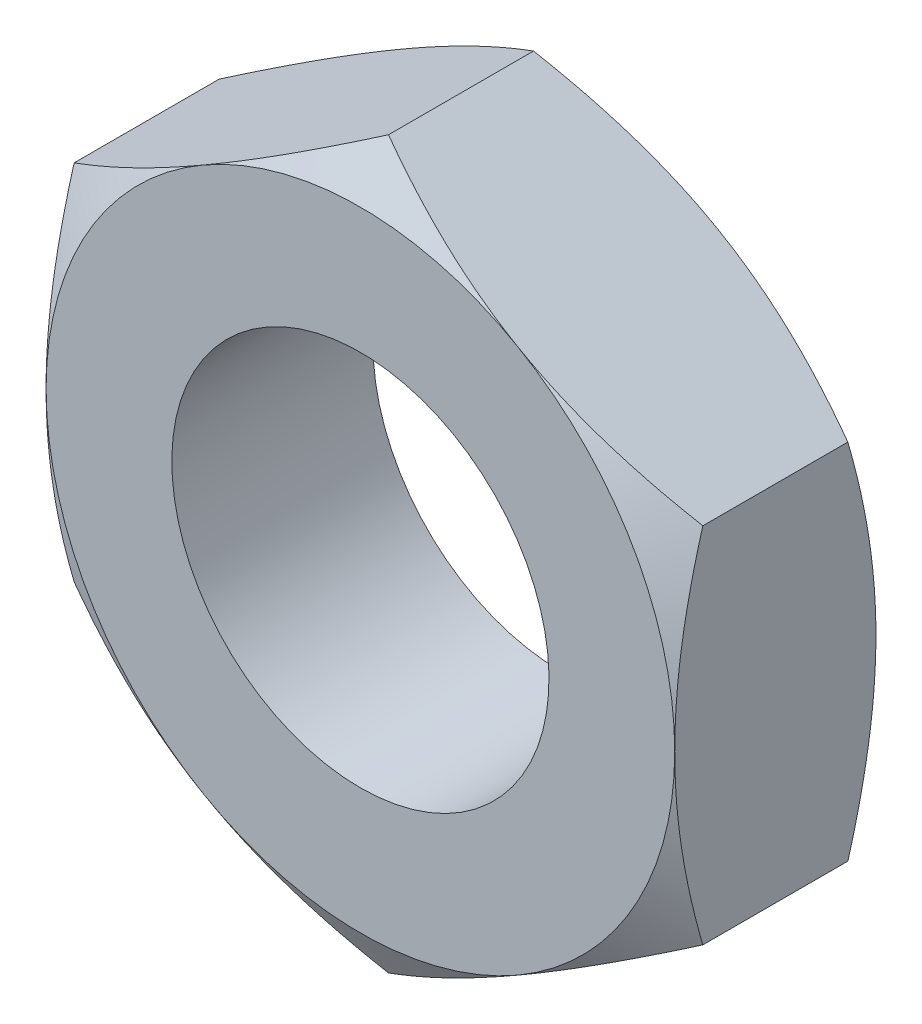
ISO-10303-21;
HEADER;
FILE_DESCRIPTION(('STEP AP214'),'2;1');
FILE_NAME('part.step','',(''),(''),'','','');
FILE_SCHEMA(('AUTOMOTIVE_DESIGN { 1 0 10303 214 1 1 1 1 }'));
ENDSEC;
DATA;
#1=APPLICATION_CONTEXT('core data for automotive mechanical design processes');
#2=APPLICATION_PROTOCOL_DEFINITION('international standard','automotive_design',2000,#1);
#3=PRODUCT_CONTEXT('',#1,'mechanical');
#4=PRODUCT('Part','Part','',(#3));
#5=PRODUCT_RELATED_PRODUCT_CATEGORY('part','',(#4));
#6=PRODUCT_DEFINITION_FORMATION('','',#4);
#7=PRODUCT_DEFINITION_CONTEXT('part definition',#1,'design');
#8=PRODUCT_DEFINITION('design','',#6,#7);
#9=PRODUCT_DEFINITION_SHAPE('','',#8);
#10=(LENGTH_UNIT() NAMED_UNIT(*) SI_UNIT(.MILLI.,.METRE.));
#11=(NAMED_UNIT(*) PLANE_ANGLE_UNIT() SI_UNIT($,.RADIAN.));
#12=(NAMED_UNIT(*) SI_UNIT($,.STERADIAN.) SOLID_ANGLE_UNIT());
#13=UNCERTAINTY_MEASURE_WITH_UNIT(LENGTH_MEASURE(1.E-05),#10,'distance_accuracy_value','');
#14=(GEOMETRIC_REPRESENTATION_CONTEXT(3) GLOBAL_UNCERTAINTY_ASSIGNED_CONTEXT((#13)) GLOBAL_UNIT_ASSIGNED_CONTEXT((#10,
#11,#12)) REPRESENTATION_CONTEXT('',''));
#15=CARTESIAN_POINT('',(0.,0.,0.));
#16=DIRECTION('',(0.,0.,1.));
#17=DIRECTION('',(1.,0.,0.));
#18=AXIS2_PLACEMENT_3D('',#15,#16,#17);
#19=CARTESIAN_POINT('',(0.,0.,3.2));
#20=DIRECTION('',(0.,0.,-1.));
#21=DIRECTION('',(1.,0.,0.));
#22=AXIS2_PLACEMENT_3D('',#19,#20,#21);
#23=CONICAL_SURFACE('',#22,5.,1.0471975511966);
#24=CARTESIAN_POINT('',(-0.000200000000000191,-5.77361816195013,2.75335134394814));
#25=CARTESIAN_POINT('',(0.219534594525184,-5.64675433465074,2.82661343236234));
#26=CARTESIAN_POINT('',(0.441148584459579,-5.51880543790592,2.89324867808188));
#27=CARTESIAN_POINT('',(0.888213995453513,-5.2606921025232,3.00956100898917));
#28=CARTESIAN_POINT('',(1.11367335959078,-5.13052307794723,3.05919695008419));
#29=CARTESIAN_POINT('',(1.56183230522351,-4.87177839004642,3.13644897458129));
#30=CARTESIAN_POINT('',(1.7844620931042,-4.74324302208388,3.1645796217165));
#31=CARTESIAN_POINT('',(2.11918990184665,-4.54998783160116,3.18980507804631));
#32=CARTESIAN_POINT('',(2.23084219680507,-4.48552534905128,3.19538654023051));
#33=CARTESIAN_POINT('',(2.4542499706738,-4.35654081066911,3.20079778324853));
#34=CARTESIAN_POINT('',(2.56600544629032,-4.29201875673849,3.2006277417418));
#35=CARTESIAN_POINT('',(2.87218423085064,-4.11524635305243,3.19224636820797));
#36=CARTESIAN_POINT('',(3.06650608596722,-4.00305457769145,3.17817022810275));
#37=CARTESIAN_POINT('',(3.45386010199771,-3.77941563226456,3.13353474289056));
#38=CARTESIAN_POINT('',(3.64689090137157,-3.66796924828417,3.10296013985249));
#39=CARTESIAN_POINT('',(4.03502534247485,-3.44387972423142,3.02653150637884));
#40=CARTESIAN_POINT('',(4.23007999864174,-3.33126486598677,2.98035362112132));
#41=CARTESIAN_POINT('',(4.61728034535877,-3.10771464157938,2.87554820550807));
#42=CARTESIAN_POINT('',(4.80943099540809,-2.99677641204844,2.81694529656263));
#43=CARTESIAN_POINT('',(5.0002,-2.88663587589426,2.75335134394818));
#44=B_SPLINE_CURVE_WITH_KNOTS('',3,(#24,#25,#26,#27,#28,#29,#30,#31,#32,#33,#34,#35,#36,#37,#38,
#39,#40,#41,#42,#43),.UNSPECIFIED.,.F.,.F.,(4,2,2,2,2,2,2,2,2,4),(0.,0.792555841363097,
1.58701660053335,2.36181537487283,2.74884076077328,3.13585419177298,3.80962362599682,
4.48401723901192,5.17336882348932,5.86136694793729),.UNSPECIFIED.);
#45=CARTESIAN_POINT('',(2.50000000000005,-4.33012701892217,3.2));
#46=VERTEX_POINT('',#45);
#47=CARTESIAN_POINT('',(5.,-2.88675134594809,2.7534180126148));
#48=VERTEX_POINT('',#47);
#49=EDGE_CURVE('E186',#46,#48,#44,.T.);
#50=ORIENTED_EDGE('',*,*,#49,.T.);
#51=CARTESIAN_POINT('',(5.,7.81723155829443,0.729229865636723));
#52=CARTESIAN_POINT('',(5.,7.59831721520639,0.83567496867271));
#53=CARTESIAN_POINT('',(5.,7.37890707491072,0.941117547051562));
#54=CARTESIAN_POINT('',(5.,6.93883178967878,1.14943507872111));
#55=CARTESIAN_POINT('',(5.,6.71816645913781,1.25230963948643));
#56=CARTESIAN_POINT('',(5.,6.27421035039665,1.45543273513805));
#57=CARTESIAN_POINT('',(5.,6.05091185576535,1.55566446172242));
#58=CARTESIAN_POINT('',(5.,5.60256083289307,1.7521097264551));
#59=CARTESIAN_POINT('',(5.,5.377508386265,1.84832345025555));
#60=CARTESIAN_POINT('',(5.,4.9177769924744,2.03878733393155));
#61=CARTESIAN_POINT('',(5.,4.68302663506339,2.1328660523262));
#62=CARTESIAN_POINT('',(5.,4.21080279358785,2.31405477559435));
#63=CARTESIAN_POINT('',(5.,3.97332901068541,2.40116400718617));
#64=CARTESIAN_POINT('',(5.,3.495705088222,2.56617303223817));
#65=CARTESIAN_POINT('',(5.,3.25556126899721,2.64409093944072));
#66=CARTESIAN_POINT('',(5.,2.77182902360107,2.78825869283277));
#67=CARTESIAN_POINT('',(5.,2.52824168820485,2.85451214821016));
#68=CARTESIAN_POINT('',(5.,2.03885564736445,2.97185534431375));
#69=CARTESIAN_POINT('',(5.,1.79307767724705,3.0230299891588));
#70=CARTESIAN_POINT('',(5.,1.29839972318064,3.10737105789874));
#71=CARTESIAN_POINT('',(5.,1.04950005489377,3.14053928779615));
#72=CARTESIAN_POINT('',(5.,0.55309848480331,3.18579003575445));
#73=CARTESIAN_POINT('',(5.,0.305622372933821,3.1981484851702));
#74=CARTESIAN_POINT('',(5.,-0.189495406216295,3.20146223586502));
#75=CARTESIAN_POINT('',(5.,-0.437137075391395,3.19241728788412));
#76=CARTESIAN_POINT('',(5.,-0.855712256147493,3.15968627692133));
#77=CARTESIAN_POINT('',(5.,-1.02708560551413,3.14128520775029));
#78=CARTESIAN_POINT('',(5.,-1.36861132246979,3.09534502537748));
#79=CARTESIAN_POINT('',(5.,-1.53876352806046,3.06780472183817));
#80=CARTESIAN_POINT('',(5.,-2.04714382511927,2.97291886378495));
#81=CARTESIAN_POINT('',(5.,-2.383113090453,2.89332456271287));
#82=CARTESIAN_POINT('',(5.,-2.88555192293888,2.75488137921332));
#83=CARTESIAN_POINT('',(5.,-3.05461483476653,2.70490439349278));
#84=CARTESIAN_POINT('',(5.,-3.39109942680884,2.59965290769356));
#85=CARTESIAN_POINT('',(5.,-3.55852109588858,2.54437837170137));
#86=CARTESIAN_POINT('',(5.,-3.89177405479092,2.42942761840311));
#87=CARTESIAN_POINT('',(5.,-4.05760582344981,2.36975277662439));
#88=CARTESIAN_POINT('',(5.,-4.38788840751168,2.24671405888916));
#89=CARTESIAN_POINT('',(5.,-4.55233924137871,2.18335023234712));
#90=CARTESIAN_POINT('',(5.,-4.94898502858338,2.02622090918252));
#91=CARTESIAN_POINT('',(5.,-5.18055706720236,1.93088560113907));
#92=CARTESIAN_POINT('',(5.,-5.64164975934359,1.73536213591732));
#93=CARTESIAN_POINT('',(5.,-5.87117026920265,1.63517364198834));
#94=CARTESIAN_POINT('',(5.,-6.32855073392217,1.43094756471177));
#95=CARTESIAN_POINT('',(5.,-6.55641029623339,1.32690910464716));
#96=CARTESIAN_POINT('',(5.,-7.01070900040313,1.11577097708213));
#97=CARTESIAN_POINT('',(5.,-7.23714810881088,1.00867123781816));
#98=CARTESIAN_POINT('',(5.,-7.91522882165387,0.683446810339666));
#99=CARTESIAN_POINT('',(5.,-8.36510205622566,0.461637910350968));
#100=CARTESIAN_POINT('',(5.,-9.26147134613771,0.0114931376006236));
#101=CARTESIAN_POINT('',(5.,-9.70796785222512,-0.216841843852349));
#102=CARTESIAN_POINT('',(5.,-10.5595470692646,-0.657922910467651));
#103=CARTESIAN_POINT('',(5.,-10.9648306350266,-0.870281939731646));
#104=CARTESIAN_POINT('',(5.,-11.7738959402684,-1.29787596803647));
#105=CARTESIAN_POINT('',(5.,-12.1776776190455,-1.51311108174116));
#106=CARTESIAN_POINT('',(5.,-12.9829857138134,-1.94518053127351));
#107=CARTESIAN_POINT('',(5.,-13.3845152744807,-2.16200901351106));
#108=CARTESIAN_POINT('',(5.,-14.1866188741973,-2.59736989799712));
#109=CARTESIAN_POINT('',(5.,-14.5871929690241,-2.81590219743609));
#110=CARTESIAN_POINT('',(5.,-14.9874182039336,-3.03506690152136));
#111=B_SPLINE_CURVE_WITH_KNOTS('',3,(#51,#52,#53,#54,#55,#56,#57,#58,#59,#60,#61,#62,#63,#64,
#65,#66,#67,#68,#69,#70,#71,#72,#73,#74,#75,#76,#77,#78,#79,#80,#81,#82,#83,#84,#85,#86,#87,#88,
#89,#90,#91,#92,#93,#94,#95,#96,#97,#98,#99,#100,#101,#102,#103,#104,#105,#106,#107,#108,#109,
#110),.UNSPECIFIED.,.F.,.F.,(4,2,2,2,2,2,2,2,2,2,2,2,2,2,2,2,2,2,2,2,2,2,2,2,2,2,2,2,2,4),(0.,
0.730273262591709,1.4606574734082,2.19491284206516,2.92913424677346,3.68774942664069,
4.44644866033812,5.20362678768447,5.96057021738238,6.71316630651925,7.46568689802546,
8.20814835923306,8.95061846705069,9.4674441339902,9.98433714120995,11.0186703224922,
11.5475092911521,12.0763518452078,12.605029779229,13.1337006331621,13.8849102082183,
14.6361719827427,15.3876059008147,16.1390574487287,17.6437115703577,19.148161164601,
20.5207929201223,21.8934795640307,23.2624765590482,24.631391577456),.UNSPECIFIED.);
#112=CARTESIAN_POINT('',(5.,0.,3.2));
#113=VERTEX_POINT('',#112);
#114=EDGE_CURVE('E210',#48,#113,#111,.F.);
#115=ORIENTED_EDGE('',*,*,#114,.T.);
#116=CARTESIAN_POINT('',(0.,0.,3.2));
#117=DIRECTION('',(0.,0.,-1.));
#118=DIRECTION('',(1.,0.,0.));
#119=AXIS2_PLACEMENT_3D('',#116,#117,#118);
#120=CIRCLE('',#119,5.);
#121=EDGE_CURVE('E281',#113,#46,#120,.T.);
#122=ORIENTED_EDGE('',*,*,#121,.T.);
#123=EDGE_LOOP('',(#50,#115,#122));
#124=FACE_BOUND('',#123,.T.);
#125=ADVANCED_FACE('F14',(#124),#23,.T.);
#126=CARTESIAN_POINT('',(2.50000000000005,4.33012701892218,3.2));
#127=VERTEX_POINT('',#126);
#128=EDGE_CURVE('E280',#127,#113,#120,.T.);
#129=ORIENTED_EDGE('',*,*,#128,.T.);
#130=CARTESIAN_POINT('',(5.,2.88675134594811,2.7534180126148));
#131=VERTEX_POINT('',#130);
#132=EDGE_CURVE('E203',#113,#131,#111,.F.);
#133=ORIENTED_EDGE('',*,*,#132,.T.);
#134=CARTESIAN_POINT('',(5.0002,2.88663587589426,2.75335134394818));
#135=CARTESIAN_POINT('',(4.78046540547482,3.01349970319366,2.82661343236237));
#136=CARTESIAN_POINT('',(4.55885141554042,3.14144859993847,2.89324867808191));
#137=CARTESIAN_POINT('',(4.1117860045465,3.3995619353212,3.00956100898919));
#138=CARTESIAN_POINT('',(3.88632664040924,3.52973095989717,3.05919695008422));
#139=CARTESIAN_POINT('',(3.4381676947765,3.78847564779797,3.13644897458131));
#140=CARTESIAN_POINT('',(3.21553790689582,3.91701101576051,3.16457962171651));
#141=CARTESIAN_POINT('',(2.88081009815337,4.11026620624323,3.18980507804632));
#142=CARTESIAN_POINT('',(2.76915780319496,4.17472868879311,3.19538654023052));
#143=CARTESIAN_POINT('',(2.54575002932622,4.30371322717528,3.20079778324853));
#144=CARTESIAN_POINT('',(2.4339945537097,4.36823528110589,3.20062774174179));
#145=CARTESIAN_POINT('',(2.12781576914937,4.54500768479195,3.19224636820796));
#146=CARTESIAN_POINT('',(1.9334939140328,4.65719946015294,3.17817022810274));
#147=CARTESIAN_POINT('',(1.54613989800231,4.88083840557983,3.13353474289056));
#148=CARTESIAN_POINT('',(1.35310909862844,4.99228478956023,3.10296013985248));
#149=CARTESIAN_POINT('',(0.964974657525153,5.21637431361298,3.02653150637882));
#150=CARTESIAN_POINT('',(0.769920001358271,5.32898917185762,2.98035362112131));
#151=CARTESIAN_POINT('',(0.382719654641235,5.55253939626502,2.87554820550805));
#152=CARTESIAN_POINT('',(0.190569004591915,5.66347762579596,2.8169452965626));
#153=CARTESIAN_POINT('',(-0.000200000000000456,5.77361816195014,2.75335134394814));
#154=B_SPLINE_CURVE_WITH_KNOTS('',3,(#134,#135,#136,#137,#138,#139,#140,#141,#142,#143,#144,
#145,#146,#147,#148,#149,#150,#151,#152,#153),.UNSPECIFIED.,.F.,.F.,(4,2,2,2,2,2,2,2,2,4),(0.,
0.792555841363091,1.58701660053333,2.3618153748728,2.74884076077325,3.13585419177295,
3.8096236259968,4.48401723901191,5.17336882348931,5.86136694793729),.UNSPECIFIED.);
#155=EDGE_CURVE('E332',#131,#127,#154,.T.);
#156=ORIENTED_EDGE('',*,*,#155,.T.);
#157=EDGE_LOOP('',(#129,#133,#156));
#158=FACE_BOUND('',#157,.T.);
#159=ADVANCED_FACE('F243',(#158),#23,.T.);
#160=CARTESIAN_POINT('',(-2.50000000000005,4.33012701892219,3.2));
#161=VERTEX_POINT('',#160);
#162=EDGE_CURVE('E277',#161,#127,#120,.T.);
#163=ORIENTED_EDGE('',*,*,#162,.T.);
#164=CARTESIAN_POINT('',(0.,5.77350269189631,2.75341801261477));
#165=VERTEX_POINT('',#164);
#166=EDGE_CURVE('E219',#127,#165,#154,.T.);
#167=ORIENTED_EDGE('',*,*,#166,.T.);
#168=CARTESIAN_POINT('',(0.000199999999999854,5.77361816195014,2.75335134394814));
#169=CARTESIAN_POINT('',(-0.219534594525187,5.64675433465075,2.82661343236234));
#170=CARTESIAN_POINT('',(-0.441148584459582,5.51880543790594,2.89324867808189));
#171=CARTESIAN_POINT('',(-0.888213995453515,5.26069210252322,3.00956100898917));
#172=CARTESIAN_POINT('',(-1.11367335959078,5.13052307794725,3.0591969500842));
#173=CARTESIAN_POINT('',(-1.56183230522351,4.87177839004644,3.13644897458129));
#174=CARTESIAN_POINT('',(-1.78446209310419,4.7432430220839,3.1645796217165));
#175=CARTESIAN_POINT('',(-2.11918990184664,4.54998783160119,3.18980507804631));
#176=CARTESIAN_POINT('',(-2.23084219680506,4.4855253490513,3.19538654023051));
#177=CARTESIAN_POINT('',(-2.4542499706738,4.35654081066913,3.20079778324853));
#178=CARTESIAN_POINT('',(-2.56600544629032,4.29201875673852,3.20062774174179));
#179=CARTESIAN_POINT('',(-2.87218423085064,4.11524635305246,3.19224636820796));
#180=CARTESIAN_POINT('',(-3.06650608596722,4.00305457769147,3.17817022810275));
#181=CARTESIAN_POINT('',(-3.45386010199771,3.77941563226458,3.13353474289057));
#182=CARTESIAN_POINT('',(-3.64689090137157,3.66796924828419,3.1029601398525));
#183=CARTESIAN_POINT('',(-4.03502534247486,3.44387972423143,3.02653150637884));
#184=CARTESIAN_POINT('',(-4.23007999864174,3.33126486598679,2.98035362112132));
#185=CARTESIAN_POINT('',(-4.61728034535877,3.10771464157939,2.87554820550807));
#186=CARTESIAN_POINT('',(-4.80943099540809,2.99677641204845,2.81694529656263));
#187=CARTESIAN_POINT('',(-5.0002,2.88663587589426,2.75335134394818));
#188=B_SPLINE_CURVE_WITH_KNOTS('',3,(#168,#169,#170,#171,#172,#173,#174,#175,#176,#177,#178,
#179,#180,#181,#182,#183,#184,#185,#186,#187),.UNSPECIFIED.,.F.,.F.,(4,2,2,2,2,2,2,2,2,4),(0.,
0.792555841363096,1.58701660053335,2.36181537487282,2.74884076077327,3.13585419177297,
3.80962362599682,4.48401723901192,5.17336882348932,5.86136694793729),.UNSPECIFIED.);
#189=EDGE_CURVE('E288',#165,#161,#188,.T.);
#190=ORIENTED_EDGE('',*,*,#189,.T.);
#191=EDGE_LOOP('',(#163,#167,#190));
#192=FACE_BOUND('',#191,.T.);
#193=ADVANCED_FACE('F248',(#192),#23,.T.);
#194=CARTESIAN_POINT('',(-5.0002,-2.88663587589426,2.75335134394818));
#195=CARTESIAN_POINT('',(-4.78046540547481,-3.01349970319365,2.82661343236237));
#196=CARTESIAN_POINT('',(-4.55885141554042,-3.14144859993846,2.89324867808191));
#197=CARTESIAN_POINT('',(-4.11178600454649,-3.39956193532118,3.00956100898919));
#198=CARTESIAN_POINT('',(-3.88632664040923,-3.52973095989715,3.05919695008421));
#199=CARTESIAN_POINT('',(-3.4381676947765,-3.78847564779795,3.1364489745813));
#200=CARTESIAN_POINT('',(-3.21553790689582,-3.9170110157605,3.16457962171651));
#201=CARTESIAN_POINT('',(-2.88081009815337,-4.11026620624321,3.18980507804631));
#202=CARTESIAN_POINT('',(-2.76915780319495,-4.17472868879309,3.19538654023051));
#203=CARTESIAN_POINT('',(-2.54575002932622,-4.30371322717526,3.20079778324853));
#204=CARTESIAN_POINT('',(-2.4339945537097,-4.36823528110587,3.20062774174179));
#205=CARTESIAN_POINT('',(-2.12781576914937,-4.54500768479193,3.19224636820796));
#206=CARTESIAN_POINT('',(-1.9334939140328,-4.65719946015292,3.17817022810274));
#207=CARTESIAN_POINT('',(-1.54613989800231,-4.88083840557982,3.13353474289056));
#208=CARTESIAN_POINT('',(-1.35310909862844,-4.99228478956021,3.10296013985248));
#209=CARTESIAN_POINT('',(-0.964974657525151,-5.21637431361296,3.02653150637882));
#210=CARTESIAN_POINT('',(-0.769920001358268,-5.3289891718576,2.9803536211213));
#211=CARTESIAN_POINT('',(-0.382719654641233,-5.55253939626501,2.87554820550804));
#212=CARTESIAN_POINT('',(-0.190569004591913,-5.66347762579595,2.8169452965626));
#213=CARTESIAN_POINT('',(0.000200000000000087,-5.77361816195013,2.75335134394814));
#214=B_SPLINE_CURVE_WITH_KNOTS('',3,(#194,#195,#196,#197,#198,#199,#200,#201,#202,#203,#204,
#205,#206,#207,#208,#209,#210,#211,#212,#213),.UNSPECIFIED.,.F.,.F.,(4,2,2,2,2,2,2,2,2,4),(0.,
0.79255584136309,1.58701660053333,2.3618153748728,2.74884076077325,3.13585419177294,
3.80962362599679,4.4840172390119,5.17336882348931,5.86136694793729),.UNSPECIFIED.);
#215=CARTESIAN_POINT('',(-2.50000000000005,-4.33012701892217,3.2));
#216=VERTEX_POINT('',#215);
#217=CARTESIAN_POINT('',(0.,-5.7735026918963,2.75341801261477));
#218=VERTEX_POINT('',#217);
#219=EDGE_CURVE('E141',#216,#218,#214,.T.);
#220=ORIENTED_EDGE('',*,*,#219,.T.);
#221=EDGE_CURVE('E193',#218,#46,#44,.T.);
#222=ORIENTED_EDGE('',*,*,#221,.T.);
#223=EDGE_CURVE('E278',#46,#216,#120,.T.);
#224=ORIENTED_EDGE('',*,*,#223,.T.);
#225=EDGE_LOOP('',(#220,#222,#224));
#226=FACE_BOUND('',#225,.T.);
#227=ADVANCED_FACE('F259',(#226),#23,.T.);
#228=CARTESIAN_POINT('',(-5.,0.,3.2));
#229=VERTEX_POINT('',#228);
#230=EDGE_CURVE('E271',#229,#161,#120,.T.);
#231=ORIENTED_EDGE('',*,*,#230,.T.);
#232=CARTESIAN_POINT('',(-5.,2.88675134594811,2.7534180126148));
#233=VERTEX_POINT('',#232);
#234=EDGE_CURVE('E272',#161,#233,#188,.T.);
#235=ORIENTED_EDGE('',*,*,#234,.T.);
#236=CARTESIAN_POINT('',(-5.,7.81723155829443,0.729229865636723));
#237=CARTESIAN_POINT('',(-5.,7.59831721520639,0.83567496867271));
#238=CARTESIAN_POINT('',(-5.,7.37890707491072,0.941117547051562));
#239=CARTESIAN_POINT('',(-5.,6.93883178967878,1.14943507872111));
#240=CARTESIAN_POINT('',(-5.,6.71816645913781,1.25230963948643));
#241=CARTESIAN_POINT('',(-5.,6.27421035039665,1.45543273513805));
#242=CARTESIAN_POINT('',(-5.,6.05091185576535,1.55566446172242));
#243=CARTESIAN_POINT('',(-5.,5.60256083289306,1.7521097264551));
#244=CARTESIAN_POINT('',(-5.,5.377508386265,1.84832345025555));
#245=CARTESIAN_POINT('',(-5.,4.9177769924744,2.03878733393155));
#246=CARTESIAN_POINT('',(-5.,4.68302663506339,2.1328660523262));
#247=CARTESIAN_POINT('',(-5.,4.21080279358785,2.31405477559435));
#248=CARTESIAN_POINT('',(-5.,3.97332901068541,2.40116400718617));
#249=CARTESIAN_POINT('',(-5.,3.495705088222,2.56617303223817));
#250=CARTESIAN_POINT('',(-5.,3.25556126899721,2.64409093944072));
#251=CARTESIAN_POINT('',(-5.,2.77182902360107,2.78825869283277));
#252=CARTESIAN_POINT('',(-5.,2.52824168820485,2.85451214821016));
#253=CARTESIAN_POINT('',(-5.,2.03885564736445,2.97185534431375));
#254=CARTESIAN_POINT('',(-5.,1.79307767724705,3.0230299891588));
#255=CARTESIAN_POINT('',(-5.,1.29839972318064,3.10737105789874));
#256=CARTESIAN_POINT('',(-5.,1.04950005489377,3.14053928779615));
#257=CARTESIAN_POINT('',(-5.,0.55309848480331,3.18579003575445));
#258=CARTESIAN_POINT('',(-5.,0.30562237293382,3.1981484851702));
#259=CARTESIAN_POINT('',(-5.,-0.189495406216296,3.20146223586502));
#260=CARTESIAN_POINT('',(-5.,-0.437137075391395,3.19241728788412));
#261=CARTESIAN_POINT('',(-5.,-0.855712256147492,3.15968627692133));
#262=CARTESIAN_POINT('',(-5.,-1.02708560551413,3.14128520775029));
#263=CARTESIAN_POINT('',(-5.,-1.36861132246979,3.09534502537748));
#264=CARTESIAN_POINT('',(-5.,-1.53876352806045,3.06780472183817));
#265=CARTESIAN_POINT('',(-5.,-2.04714382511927,2.97291886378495));
#266=CARTESIAN_POINT('',(-5.,-2.383113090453,2.89332456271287));
#267=CARTESIAN_POINT('',(-5.,-2.88555192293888,2.75488137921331));
#268=CARTESIAN_POINT('',(-5.,-3.05461483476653,2.70490439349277));
#269=CARTESIAN_POINT('',(-5.,-3.39109942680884,2.59965290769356));
#270=CARTESIAN_POINT('',(-5.,-3.55852109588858,2.54437837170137));
#271=CARTESIAN_POINT('',(-5.,-3.89177405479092,2.42942761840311));
#272=CARTESIAN_POINT('',(-5.,-4.05760582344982,2.36975277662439));
#273=CARTESIAN_POINT('',(-5.,-4.38788840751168,2.24671405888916));
#274=CARTESIAN_POINT('',(-5.,-4.55233924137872,2.18335023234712));
#275=CARTESIAN_POINT('',(-5.,-4.94898502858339,2.02622090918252));
#276=CARTESIAN_POINT('',(-5.,-5.18055706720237,1.93088560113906));
#277=CARTESIAN_POINT('',(-5.,-5.6416497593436,1.73536213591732));
#278=CARTESIAN_POINT('',(-5.,-5.87117026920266,1.63517364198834));
#279=CARTESIAN_POINT('',(-5.,-6.32855073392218,1.43094756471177));
#280=CARTESIAN_POINT('',(-5.,-6.5564102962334,1.32690910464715));
#281=CARTESIAN_POINT('',(-5.,-7.01070900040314,1.11577097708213));
#282=CARTESIAN_POINT('',(-5.,-7.23714810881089,1.00867123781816));
#283=CARTESIAN_POINT('',(-5.,-7.91522882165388,0.683446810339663));
#284=CARTESIAN_POINT('',(-5.,-8.36510205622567,0.461637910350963));
#285=CARTESIAN_POINT('',(-5.,-9.26147134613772,0.0114931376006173));
#286=CARTESIAN_POINT('',(-5.,-9.70796785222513,-0.216841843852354));
#287=CARTESIAN_POINT('',(-5.,-10.5595470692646,-0.657922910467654));
#288=CARTESIAN_POINT('',(-5.,-10.9648306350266,-0.870281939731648));
#289=CARTESIAN_POINT('',(-5.,-11.7738959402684,-1.29787596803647));
#290=CARTESIAN_POINT('',(-5.,-12.1776776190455,-1.51311108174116));
#291=CARTESIAN_POINT('',(-5.,-12.9829857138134,-1.94518053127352));
#292=CARTESIAN_POINT('',(-5.,-13.3845152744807,-2.16200901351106));
#293=CARTESIAN_POINT('',(-5.,-14.1866188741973,-2.59736989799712));
#294=CARTESIAN_POINT('',(-5.,-14.5871929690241,-2.81590219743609));
#295=CARTESIAN_POINT('',(-5.,-14.9874182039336,-3.03506690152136));
#296=B_SPLINE_CURVE_WITH_KNOTS('',3,(#236,#237,#238,#239,#240,#241,#242,#243,#244,#245,#246,
#247,#248,#249,#250,#251,#252,#253,#254,#255,#256,#257,#258,#259,#260,#261,#262,#263,#264,#265,
#266,#267,#268,#269,#270,#271,#272,#273,#274,#275,#276,#277,#278,#279,#280,#281,#282,#283,#284,
#285,#286,#287,#288,#289,#290,#291,#292,#293,#294,#295),.UNSPECIFIED.,.F.,.F.,(4,2,2,2,2,2,2,2,
2,2,2,2,2,2,2,2,2,2,2,2,2,2,2,2,2,2,2,2,2,4),(0.,0.730273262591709,1.4606574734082,
2.19491284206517,2.92913424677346,3.68774942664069,4.44644866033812,5.20362678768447,
5.96057021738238,6.71316630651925,7.46568689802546,8.20814835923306,8.95061846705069,
9.46744413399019,9.98433714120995,11.0186703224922,11.5475092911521,12.0763518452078,
12.605029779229,13.1337006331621,13.8849102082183,14.6361719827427,15.3876059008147,
16.1390574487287,17.6437115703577,19.148161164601,20.5207929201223,21.8934795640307,
23.2624765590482,24.631391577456),.UNSPECIFIED.);
#297=EDGE_CURVE('E146',#233,#229,#296,.T.);
#298=ORIENTED_EDGE('',*,*,#297,.T.);
#299=EDGE_LOOP('',(#231,#235,#298));
#300=FACE_BOUND('',#299,.T.);
#301=ADVANCED_FACE('F252',(#300),#23,.T.);
#302=CARTESIAN_POINT('',(0.,0.,1.6));
#303=DIRECTION('',(0.,0.,1.));
#304=DIRECTION('',(-1.,0.,0.));
#305=AXIS2_PLACEMENT_3D('',#302,#303,#304);
#306=CONICAL_SURFACE('',#305,7.7712812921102,1.0471975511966);
#307=CARTESIAN_POINT('',(-5.,7.81723155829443,2.47077013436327));
#308=CARTESIAN_POINT('',(-5.,7.59831721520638,2.36432503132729));
#309=CARTESIAN_POINT('',(-5.,7.37890707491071,2.25888245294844));
#310=CARTESIAN_POINT('',(-5.,6.93883178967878,2.05056492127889));
#311=CARTESIAN_POINT('',(-5.,6.71816645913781,1.94769036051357));
#312=CARTESIAN_POINT('',(-5.,6.27421035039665,1.74456726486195));
#313=CARTESIAN_POINT('',(-5.,6.05091185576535,1.64433553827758));
#314=CARTESIAN_POINT('',(-5.,5.60256083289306,1.4478902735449));
#315=CARTESIAN_POINT('',(-5.,5.37750838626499,1.35167654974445));
#316=CARTESIAN_POINT('',(-5.,4.9177769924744,1.16121266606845));
#317=CARTESIAN_POINT('',(-5.,4.68302663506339,1.06713394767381));
#318=CARTESIAN_POINT('',(-5.,4.21080279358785,0.885945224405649));
#319=CARTESIAN_POINT('',(-5.,3.97332901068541,0.798835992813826));
#320=CARTESIAN_POINT('',(-5.,3.495705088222,0.633826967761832));
#321=CARTESIAN_POINT('',(-5.,3.25556126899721,0.555909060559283));
#322=CARTESIAN_POINT('',(-5.,2.77182902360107,0.411741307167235));
#323=CARTESIAN_POINT('',(-5.,2.52824168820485,0.345487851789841));
#324=CARTESIAN_POINT('',(-5.,2.03885564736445,0.228144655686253));
#325=CARTESIAN_POINT('',(-5.,1.79307767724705,0.1769700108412));
#326=CARTESIAN_POINT('',(-5.,1.29839972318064,0.0926289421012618));
#327=CARTESIAN_POINT('',(-5.,1.04950005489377,0.0594607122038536));
#328=CARTESIAN_POINT('',(-5.,0.553098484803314,0.014209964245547));
#329=CARTESIAN_POINT('',(-5.,0.305622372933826,0.00185151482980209));
#330=CARTESIAN_POINT('',(-5.,-0.189495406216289,-0.00146223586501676));
#331=CARTESIAN_POINT('',(-5.,-0.437137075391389,0.00758271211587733));
#332=CARTESIAN_POINT('',(-5.,-0.855712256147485,0.0403137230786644));
#333=CARTESIAN_POINT('',(-5.,-1.02708560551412,0.0587147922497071));
#334=CARTESIAN_POINT('',(-5.,-1.36861132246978,0.104654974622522));
#335=CARTESIAN_POINT('',(-5.,-1.53876352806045,0.132195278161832));
#336=CARTESIAN_POINT('',(-5.,-2.04714382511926,0.227081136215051));
#337=CARTESIAN_POINT('',(-5.,-2.38311309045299,0.306675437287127));
#338=CARTESIAN_POINT('',(-5.,-2.88555192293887,0.445118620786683));
#339=CARTESIAN_POINT('',(-5.,-3.05461483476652,0.495095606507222));
#340=CARTESIAN_POINT('',(-5.,-3.39109942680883,0.600347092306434));
#341=CARTESIAN_POINT('',(-5.,-3.55852109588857,0.65562162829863));
#342=CARTESIAN_POINT('',(-5.,-3.89177405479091,0.770572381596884));
#343=CARTESIAN_POINT('',(-5.,-4.0576058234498,0.830247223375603));
#344=CARTESIAN_POINT('',(-5.,-4.38788840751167,0.953285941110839));
#345=CARTESIAN_POINT('',(-5.,-4.5523392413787,1.01664976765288));
#346=CARTESIAN_POINT('',(-5.,-4.94898502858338,1.17377909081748));
#347=CARTESIAN_POINT('',(-5.,-5.18055706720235,1.26911439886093));
#348=CARTESIAN_POINT('',(-5.,-5.64164975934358,1.46463786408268));
#349=CARTESIAN_POINT('',(-5.,-5.87117026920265,1.56482635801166));
#350=CARTESIAN_POINT('',(-5.,-6.32855073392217,1.76905243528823));
#351=CARTESIAN_POINT('',(-5.,-6.55641029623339,1.87309089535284));
#352=CARTESIAN_POINT('',(-5.,-7.01070900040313,2.08422902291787));
#353=CARTESIAN_POINT('',(-5.,-7.23714810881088,2.19132876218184));
#354=CARTESIAN_POINT('',(-5.,-7.91522882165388,2.51655318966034));
#355=CARTESIAN_POINT('',(-5.,-8.36510205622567,2.73836208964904));
#356=CARTESIAN_POINT('',(-5.,-9.26147134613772,3.18850686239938));
#357=CARTESIAN_POINT('',(-5.,-9.70796785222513,3.41684184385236));
#358=CARTESIAN_POINT('',(-5.,-10.5595470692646,3.85792291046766));
#359=CARTESIAN_POINT('',(-5.,-10.9648306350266,4.07028193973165));
#360=CARTESIAN_POINT('',(-5.,-11.7738959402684,4.49787596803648));
#361=CARTESIAN_POINT('',(-5.,-12.1776776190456,4.71311108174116));
#362=CARTESIAN_POINT('',(-5.,-12.9829857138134,5.14518053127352));
#363=CARTESIAN_POINT('',(-5.,-13.3845152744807,5.36200901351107));
#364=CARTESIAN_POINT('',(-5.,-14.1866188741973,5.79736989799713));
#365=CARTESIAN_POINT('',(-5.,-14.5871929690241,6.0159021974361));
#366=CARTESIAN_POINT('',(-5.,-14.9874182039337,6.23506690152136));
#367=B_SPLINE_CURVE_WITH_KNOTS('',3,(#307,#308,#309,#310,#311,#312,#313,#314,#315,#316,#317,
#318,#319,#320,#321,#322,#323,#324,#325,#326,#327,#328,#329,#330,#331,#332,#333,#334,#335,#336,
#337,#338,#339,#340,#341,#342,#343,#344,#345,#346,#347,#348,#349,#350,#351,#352,#353,#354,#355,
#356,#357,#358,#359,#360,#361,#362,#363,#364,#365,#366),.UNSPECIFIED.,.F.,.F.,(4,2,2,2,2,2,2,2,
2,2,2,2,2,2,2,2,2,2,2,2,2,2,2,2,2,2,2,2,2,4),(0.,0.730273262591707,1.46065747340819,
2.19491284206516,2.92913424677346,3.68774942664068,4.44644866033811,5.20362678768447,
5.96057021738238,6.71316630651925,7.46568689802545,8.20814835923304,8.95061846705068,
9.46744413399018,9.98433714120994,11.0186703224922,11.5475092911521,12.0763518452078,
12.605029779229,13.133700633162,13.8849102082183,14.6361719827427,15.3876059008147,
16.1390574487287,17.6437115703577,19.148161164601,20.5207929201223,21.8934795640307,
23.2624765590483,24.631391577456),.UNSPECIFIED.);
#368=CARTESIAN_POINT('',(-5.,0.,0.));
#369=VERTEX_POINT('',#368);
#370=CARTESIAN_POINT('',(-5.,2.88675134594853,0.446581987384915));
#371=VERTEX_POINT('',#370);
#372=EDGE_CURVE('E102',#369,#371,#367,.F.);
#373=ORIENTED_EDGE('',*,*,#372,.T.);
#374=CARTESIAN_POINT('',(-5.0002,2.88663587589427,0.446648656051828));
#375=CARTESIAN_POINT('',(-4.78046540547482,3.01349970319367,0.373386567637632));
#376=CARTESIAN_POINT('',(-4.55885141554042,3.14144859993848,0.306751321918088));
#377=CARTESIAN_POINT('',(-4.11178600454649,3.3995619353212,0.190438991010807));
#378=CARTESIAN_POINT('',(-3.88632664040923,3.52973095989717,0.140803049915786));
#379=CARTESIAN_POINT('',(-3.4381676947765,3.78847564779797,0.0635510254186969));
#380=CARTESIAN_POINT('',(-3.21553790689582,3.91701101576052,0.0354203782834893));
#381=CARTESIAN_POINT('',(-2.88081009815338,4.11026620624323,0.0101949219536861));
#382=CARTESIAN_POINT('',(-2.76915780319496,4.17472868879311,0.00461345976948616));
#383=CARTESIAN_POINT('',(-2.54575002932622,4.30371322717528,-0.000797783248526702));
#384=CARTESIAN_POINT('',(-2.43399455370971,4.3682352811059,-0.000627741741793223));
#385=CARTESIAN_POINT('',(-2.12781576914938,4.54500768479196,0.00775363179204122));
#386=CARTESIAN_POINT('',(-1.9334939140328,4.65719946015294,0.0218297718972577));
#387=CARTESIAN_POINT('',(-1.54613989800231,4.88083840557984,0.0664652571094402));
#388=CARTESIAN_POINT('',(-1.35310909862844,4.99228478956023,0.0970398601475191));
#389=CARTESIAN_POINT('',(-0.964974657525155,5.21637431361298,0.173468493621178));
#390=CARTESIAN_POINT('',(-0.769920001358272,5.32898917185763,0.219646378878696));
#391=CARTESIAN_POINT('',(-0.382719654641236,5.55253939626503,0.324451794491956));
#392=CARTESIAN_POINT('',(-0.190569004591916,5.66347762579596,0.383054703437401));
#393=CARTESIAN_POINT('',(0.000199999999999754,5.77361816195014,0.446648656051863));
#394=B_SPLINE_CURVE_WITH_KNOTS('',3,(#374,#375,#376,#377,#378,#379,#380,#381,#382,#383,#384,
#385,#386,#387,#388,#389,#390,#391,#392,#393),.UNSPECIFIED.,.F.,.F.,(4,2,2,2,2,2,2,2,2,4),(0.,
0.79255584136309,1.58701660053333,2.3618153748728,2.74884076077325,3.13585419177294,
3.8096236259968,4.48401723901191,5.17336882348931,5.86136694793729),.UNSPECIFIED.);
#395=CARTESIAN_POINT('',(-2.50000000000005,4.33012701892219,0.));
#396=VERTEX_POINT('',#395);
#397=EDGE_CURVE('E123',#371,#396,#394,.T.);
#398=ORIENTED_EDGE('',*,*,#397,.T.);
#399=CARTESIAN_POINT('',(0.,0.,0.));
#400=DIRECTION('',(0.,0.,-1.));
#401=DIRECTION('',(1.,0.,0.));
#402=AXIS2_PLACEMENT_3D('',#399,#400,#401);
#403=CIRCLE('',#402,5.);
#404=EDGE_CURVE('E121',#369,#396,#403,.T.);
#405=ORIENTED_EDGE('',*,*,#404,.F.);
#406=EDGE_LOOP('',(#373,#398,#405));
#407=FACE_BOUND('',#406,.T.);
#408=ADVANCED_FACE('F122',(#407),#306,.T.);
#409=CARTESIAN_POINT('',(2.50000000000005,4.33012701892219,0.));
#410=VERTEX_POINT('',#409);
#411=EDGE_CURVE('E127',#396,#410,#403,.T.);
#412=ORIENTED_EDGE('',*,*,#411,.F.);
#413=CARTESIAN_POINT('',(0.,5.77350269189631,0.44658198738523));
#414=VERTEX_POINT('',#413);
#415=EDGE_CURVE('E289',#396,#414,#394,.T.);
#416=ORIENTED_EDGE('',*,*,#415,.T.);
#417=CARTESIAN_POINT('',(-0.000200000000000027,5.77361816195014,0.446648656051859));
#418=CARTESIAN_POINT('',(0.219534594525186,5.64675433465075,0.373386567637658));
#419=CARTESIAN_POINT('',(0.441148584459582,5.51880543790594,0.306751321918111));
#420=CARTESIAN_POINT('',(0.888213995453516,5.26069210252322,0.190438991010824));
#421=CARTESIAN_POINT('',(1.11367335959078,5.13052307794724,0.140803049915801));
#422=CARTESIAN_POINT('',(1.56183230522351,4.87177839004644,0.0635510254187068));
#423=CARTESIAN_POINT('',(1.7844620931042,4.74324302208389,0.0354203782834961));
#424=CARTESIAN_POINT('',(2.11918990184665,4.54998783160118,0.0101949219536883));
#425=CARTESIAN_POINT('',(2.23084219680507,4.4855253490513,0.00461345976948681));
#426=CARTESIAN_POINT('',(2.4542499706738,4.35654081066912,-0.000797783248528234));
#427=CARTESIAN_POINT('',(2.56600544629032,4.29201875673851,-0.000627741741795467));
#428=CARTESIAN_POINT('',(2.87218423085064,4.11524635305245,0.00775363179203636));
#429=CARTESIAN_POINT('',(3.06650608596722,4.00305457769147,0.0218297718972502));
#430=CARTESIAN_POINT('',(3.45386010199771,3.77941563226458,0.0664652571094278));
#431=CARTESIAN_POINT('',(3.64689090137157,3.66796924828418,0.0970398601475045));
#432=CARTESIAN_POINT('',(4.03502534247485,3.44387972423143,0.173468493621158));
#433=CARTESIAN_POINT('',(4.23007999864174,3.33126486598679,0.219646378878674));
#434=CARTESIAN_POINT('',(4.61728034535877,3.10771464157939,0.324451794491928));
#435=CARTESIAN_POINT('',(4.80943099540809,2.99677641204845,0.38305470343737));
#436=CARTESIAN_POINT('',(5.0002,2.88663587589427,0.446648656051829));
#437=B_SPLINE_CURVE_WITH_KNOTS('',3,(#417,#418,#419,#420,#421,#422,#423,#424,#425,#426,#427,
#428,#429,#430,#431,#432,#433,#434,#435,#436),.UNSPECIFIED.,.F.,.F.,(4,2,2,2,2,2,2,2,2,4),(0.,
0.792555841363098,1.58701660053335,2.36181537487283,2.74884076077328,3.13585419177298,
3.80962362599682,4.48401723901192,5.17336882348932,5.86136694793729),.UNSPECIFIED.);
#438=EDGE_CURVE('E218',#414,#410,#437,.T.);
#439=ORIENTED_EDGE('',*,*,#438,.T.);
#440=EDGE_LOOP('',(#412,#416,#439));
#441=FACE_BOUND('',#440,.T.);
#442=ADVANCED_FACE('F265',(#441),#306,.T.);
#443=CARTESIAN_POINT('',(5.,0.,0.));
#444=VERTEX_POINT('',#443);
#445=EDGE_CURVE('E24',#410,#444,#403,.T.);
#446=ORIENTED_EDGE('',*,*,#445,.F.);
#447=CARTESIAN_POINT('',(5.,2.88675134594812,0.446581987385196));
#448=VERTEX_POINT('',#447);
#449=EDGE_CURVE('E211',#410,#448,#437,.T.);
#450=ORIENTED_EDGE('',*,*,#449,.T.);
#451=CARTESIAN_POINT('',(5.,7.81723155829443,2.47077013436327));
#452=CARTESIAN_POINT('',(5.,7.59831721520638,2.36432503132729));
#453=CARTESIAN_POINT('',(5.,7.37890707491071,2.25888245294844));
#454=CARTESIAN_POINT('',(5.,6.93883178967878,2.05056492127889));
#455=CARTESIAN_POINT('',(5.,6.71816645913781,1.94769036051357));
#456=CARTESIAN_POINT('',(5.,6.27421035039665,1.74456726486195));
#457=CARTESIAN_POINT('',(5.,6.05091185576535,1.64433553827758));
#458=CARTESIAN_POINT('',(5.,5.60256083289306,1.4478902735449));
#459=CARTESIAN_POINT('',(5.,5.377508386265,1.35167654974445));
#460=CARTESIAN_POINT('',(5.,4.9177769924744,1.16121266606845));
#461=CARTESIAN_POINT('',(5.,4.68302663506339,1.06713394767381));
#462=CARTESIAN_POINT('',(5.,4.21080279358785,0.885945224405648));
#463=CARTESIAN_POINT('',(5.,3.97332901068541,0.798835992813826));
#464=CARTESIAN_POINT('',(5.,3.495705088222,0.633826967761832));
#465=CARTESIAN_POINT('',(5.,3.25556126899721,0.555909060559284));
#466=CARTESIAN_POINT('',(5.,2.77182902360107,0.411741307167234));
#467=CARTESIAN_POINT('',(5.,2.52824168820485,0.345487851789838));
#468=CARTESIAN_POINT('',(5.,2.03885564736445,0.228144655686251));
#469=CARTESIAN_POINT('',(5.,1.79307767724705,0.1769700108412));
#470=CARTESIAN_POINT('',(5.,1.29839972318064,0.0926289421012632));
#471=CARTESIAN_POINT('',(5.,1.04950005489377,0.0594607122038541));
#472=CARTESIAN_POINT('',(5.,0.553098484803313,0.0142099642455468));
#473=CARTESIAN_POINT('',(5.,0.305622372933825,0.00185151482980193));
#474=CARTESIAN_POINT('',(5.,-0.18949540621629,-0.00146223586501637));
#475=CARTESIAN_POINT('',(5.,-0.437137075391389,0.00758271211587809));
#476=CARTESIAN_POINT('',(5.,-0.855712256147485,0.0403137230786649));
#477=CARTESIAN_POINT('',(5.,-1.02708560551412,0.0587147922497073));
#478=CARTESIAN_POINT('',(5.,-1.36861132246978,0.104654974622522));
#479=CARTESIAN_POINT('',(5.,-1.53876352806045,0.132195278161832));
#480=CARTESIAN_POINT('',(5.,-2.04714382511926,0.227081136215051));
#481=CARTESIAN_POINT('',(5.,-2.38311309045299,0.306675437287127));
#482=CARTESIAN_POINT('',(5.,-2.88555192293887,0.445118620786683));
#483=CARTESIAN_POINT('',(5.,-3.05461483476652,0.495095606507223));
#484=CARTESIAN_POINT('',(5.,-3.39109942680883,0.600347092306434));
#485=CARTESIAN_POINT('',(5.,-3.55852109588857,0.655621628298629));
#486=CARTESIAN_POINT('',(5.,-3.89177405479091,0.770572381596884));
#487=CARTESIAN_POINT('',(5.,-4.0576058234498,0.830247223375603));
#488=CARTESIAN_POINT('',(5.,-4.38788840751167,0.953285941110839));
#489=CARTESIAN_POINT('',(5.,-4.5523392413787,1.01664976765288));
#490=CARTESIAN_POINT('',(5.,-4.94898502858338,1.17377909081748));
#491=CARTESIAN_POINT('',(5.,-5.18055706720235,1.26911439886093));
#492=CARTESIAN_POINT('',(5.,-5.64164975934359,1.46463786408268));
#493=CARTESIAN_POINT('',(5.,-5.87117026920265,1.56482635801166));
#494=CARTESIAN_POINT('',(5.,-6.32855073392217,1.76905243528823));
#495=CARTESIAN_POINT('',(5.,-6.55641029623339,1.87309089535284));
#496=CARTESIAN_POINT('',(5.,-7.01070900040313,2.08422902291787));
#497=CARTESIAN_POINT('',(5.,-7.23714810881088,2.19132876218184));
#498=CARTESIAN_POINT('',(5.,-7.91522882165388,2.51655318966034));
#499=CARTESIAN_POINT('',(5.,-8.36510205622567,2.73836208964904));
#500=CARTESIAN_POINT('',(5.,-9.26147134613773,3.18850686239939));
#501=CARTESIAN_POINT('',(5.,-9.70796785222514,3.41684184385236));
#502=CARTESIAN_POINT('',(5.,-10.5595470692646,3.85792291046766));
#503=CARTESIAN_POINT('',(5.,-10.9648306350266,4.07028193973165));
#504=CARTESIAN_POINT('',(5.,-11.7738959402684,4.49787596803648));
#505=CARTESIAN_POINT('',(5.,-12.1776776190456,4.71311108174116));
#506=CARTESIAN_POINT('',(5.,-12.9829857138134,5.14518053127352));
#507=CARTESIAN_POINT('',(5.,-13.3845152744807,5.36200901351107));
#508=CARTESIAN_POINT('',(5.,-14.1866188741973,5.79736989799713));
#509=CARTESIAN_POINT('',(5.,-14.5871929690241,6.0159021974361));
#510=CARTESIAN_POINT('',(5.,-14.9874182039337,6.23506690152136));
#511=B_SPLINE_CURVE_WITH_KNOTS('',3,(#451,#452,#453,#454,#455,#456,#457,#458,#459,#460,#461,
#462,#463,#464,#465,#466,#467,#468,#469,#470,#471,#472,#473,#474,#475,#476,#477,#478,#479,#480,
#481,#482,#483,#484,#485,#486,#487,#488,#489,#490,#491,#492,#493,#494,#495,#496,#497,#498,#499,
#500,#501,#502,#503,#504,#505,#506,#507,#508,#509,#510),.UNSPECIFIED.,.F.,.F.,(4,2,2,2,2,2,2,2,
2,2,2,2,2,2,2,2,2,2,2,2,2,2,2,2,2,2,2,2,2,4),(0.,0.730273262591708,1.46065747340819,
2.19491284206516,2.92913424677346,3.68774942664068,4.44644866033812,5.20362678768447,
5.96057021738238,6.71316630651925,7.46568689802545,8.20814835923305,8.95061846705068,
9.46744413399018,9.98433714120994,11.0186703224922,11.5475092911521,12.0763518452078,
12.605029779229,13.133700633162,13.8849102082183,14.6361719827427,15.3876059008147,
16.1390574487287,17.6437115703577,19.1481611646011,20.5207929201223,21.8934795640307,
23.2624765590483,24.631391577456),.UNSPECIFIED.);
#512=EDGE_CURVE('E202',#448,#444,#511,.T.);
#513=ORIENTED_EDGE('',*,*,#512,.T.);
#514=EDGE_LOOP('',(#446,#450,#513));
#515=FACE_BOUND('',#514,.T.);
#516=ADVANCED_FACE('F337',(#515),#306,.T.);
#517=CARTESIAN_POINT('',(2.50000000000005,-4.33012701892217,0.));
#518=VERTEX_POINT('',#517);
#519=EDGE_CURVE('E9',#444,#518,#403,.T.);
#520=ORIENTED_EDGE('',*,*,#519,.F.);
#521=CARTESIAN_POINT('',(5.,-2.88675134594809,0.446581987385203));
#522=VERTEX_POINT('',#521);
#523=EDGE_CURVE('E195',#444,#522,#511,.T.);
#524=ORIENTED_EDGE('',*,*,#523,.T.);
#525=CARTESIAN_POINT('',(5.0002,-2.88663587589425,0.446648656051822));
#526=CARTESIAN_POINT('',(4.78046540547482,-3.01349970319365,0.373386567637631));
#527=CARTESIAN_POINT('',(4.55885141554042,-3.14144859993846,0.30675132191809));
#528=CARTESIAN_POINT('',(4.11178600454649,-3.39956193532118,0.190438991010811));
#529=CARTESIAN_POINT('',(3.88632664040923,-3.52973095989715,0.14080304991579));
#530=CARTESIAN_POINT('',(3.4381676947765,-3.78847564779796,0.0635510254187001));
#531=CARTESIAN_POINT('',(3.21553790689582,-3.9170110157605,0.0354203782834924));
#532=CARTESIAN_POINT('',(2.88081009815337,-4.11026620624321,0.01019492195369));
#533=CARTESIAN_POINT('',(2.76915780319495,-4.17472868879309,0.0046134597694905));
#534=CARTESIAN_POINT('',(2.54575002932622,-4.30371322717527,-0.000797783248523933));
#535=CARTESIAN_POINT('',(2.43399455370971,-4.36823528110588,-0.000627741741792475));
#536=CARTESIAN_POINT('',(2.12781576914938,-4.54500768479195,0.00775363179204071));
#537=CARTESIAN_POINT('',(1.9334939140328,-4.65719946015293,0.0218297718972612));
#538=CARTESIAN_POINT('',(1.5461398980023,-4.88083840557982,0.0664652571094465));
#539=CARTESIAN_POINT('',(1.35310909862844,-4.99228478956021,0.0970398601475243));
#540=CARTESIAN_POINT('',(0.96497465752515,-5.21637431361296,0.173468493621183));
#541=CARTESIAN_POINT('',(0.769920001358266,-5.32898917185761,0.219646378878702));
#542=CARTESIAN_POINT('',(0.382719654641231,-5.55253939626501,0.324451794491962));
#543=CARTESIAN_POINT('',(0.190569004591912,-5.66347762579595,0.383054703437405));
#544=CARTESIAN_POINT('',(-0.000199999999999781,-5.77361816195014,0.446648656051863));
#545=B_SPLINE_CURVE_WITH_KNOTS('',3,(#525,#526,#527,#528,#529,#530,#531,#532,#533,#534,#535,
#536,#537,#538,#539,#540,#541,#542,#543,#544),.UNSPECIFIED.,.F.,.F.,(4,2,2,2,2,2,2,2,2,4),(0.,
0.79255584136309,1.58701660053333,2.3618153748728,2.74884076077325,3.13585419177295,
3.8096236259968,4.48401723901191,5.17336882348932,5.8613669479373),.UNSPECIFIED.);
#546=EDGE_CURVE('E194',#522,#518,#545,.T.);
#547=ORIENTED_EDGE('',*,*,#546,.T.);
#548=EDGE_LOOP('',(#520,#524,#547));
#549=FACE_BOUND('',#548,.T.);
#550=ADVANCED_FACE('F256',(#549),#306,.T.);
#551=CARTESIAN_POINT('',(-2.50000000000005,-4.33012701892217,0.));
#552=VERTEX_POINT('',#551);
#553=EDGE_CURVE('E23',#518,#552,#403,.T.);
#554=ORIENTED_EDGE('',*,*,#553,.F.);
#555=CARTESIAN_POINT('',(0.,-5.7735026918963,0.446581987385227));
#556=VERTEX_POINT('',#555);
#557=EDGE_CURVE('E136',#518,#556,#545,.T.);
#558=ORIENTED_EDGE('',*,*,#557,.T.);
#559=CARTESIAN_POINT('',(0.000199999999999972,-5.77361816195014,0.446648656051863));
#560=CARTESIAN_POINT('',(-0.219534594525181,-5.64675433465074,0.373386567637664));
#561=CARTESIAN_POINT('',(-0.441148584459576,-5.51880543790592,0.306751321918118));
#562=CARTESIAN_POINT('',(-0.888213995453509,-5.2606921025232,0.190438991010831));
#563=CARTESIAN_POINT('',(-1.11367335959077,-5.13052307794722,0.140803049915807));
#564=CARTESIAN_POINT('',(-1.56183230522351,-4.87177839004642,0.0635510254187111));
#565=CARTESIAN_POINT('',(-1.78446209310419,-4.74324302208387,0.0354203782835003));
#566=CARTESIAN_POINT('',(-2.11918990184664,-4.54998783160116,0.0101949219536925));
#567=CARTESIAN_POINT('',(-2.23084219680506,-4.48552534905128,0.00461345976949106));
#568=CARTESIAN_POINT('',(-2.4542499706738,-4.3565408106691,-0.000797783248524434));
#569=CARTESIAN_POINT('',(-2.56600544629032,-4.29201875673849,-0.000627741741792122));
#570=CARTESIAN_POINT('',(-2.87218423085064,-4.11524635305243,0.00775363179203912));
#571=CARTESIAN_POINT('',(-3.06650608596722,-4.00305457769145,0.0218297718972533));
#572=CARTESIAN_POINT('',(-3.45386010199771,-3.77941563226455,0.0664652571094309));
#573=CARTESIAN_POINT('',(-3.64689090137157,-3.66796924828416,0.0970398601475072));
#574=CARTESIAN_POINT('',(-4.03502534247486,-3.44387972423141,0.173468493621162));
#575=CARTESIAN_POINT('',(-4.23007999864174,-3.33126486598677,0.219646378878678));
#576=CARTESIAN_POINT('',(-4.61728034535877,-3.10771464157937,0.32445179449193));
#577=CARTESIAN_POINT('',(-4.80943099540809,-2.99677641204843,0.383054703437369));
#578=CARTESIAN_POINT('',(-5.0002,-2.88663587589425,0.446648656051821));
#579=B_SPLINE_CURVE_WITH_KNOTS('',3,(#559,#560,#561,#562,#563,#564,#565,#566,#567,#568,#569,
#570,#571,#572,#573,#574,#575,#576,#577,#578),.UNSPECIFIED.,.F.,.F.,(4,2,2,2,2,2,2,2,2,4),(0.,
0.7925558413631,1.58701660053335,2.36181537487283,2.74884076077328,3.13585419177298,
3.80962362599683,4.48401723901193,5.17336882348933,5.8613669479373),.UNSPECIFIED.);
#580=EDGE_CURVE('E137',#556,#552,#579,.T.);
#581=ORIENTED_EDGE('',*,*,#580,.T.);
#582=EDGE_LOOP('',(#554,#558,#581));
#583=FACE_BOUND('',#582,.T.);
#584=ADVANCED_FACE('F135',(#583),#306,.T.);
#585=CARTESIAN_POINT('',(-5.,-2.88675134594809,2.7534180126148));
#586=VERTEX_POINT('',#585);
#587=EDGE_CURVE('E119',#229,#586,#296,.T.);
#588=ORIENTED_EDGE('',*,*,#587,.T.);
#589=EDGE_CURVE('E144',#586,#216,#214,.T.);
#590=ORIENTED_EDGE('',*,*,#589,.T.);
#591=EDGE_CURVE('E276',#216,#229,#120,.T.);
#592=ORIENTED_EDGE('',*,*,#591,.T.);
#593=EDGE_LOOP('',(#588,#590,#592));
#594=FACE_BOUND('',#593,.T.);
#595=ADVANCED_FACE('F16',(#594),#23,.T.);
#596=EDGE_CURVE('E116',#552,#369,#403,.T.);
#597=ORIENTED_EDGE('',*,*,#596,.F.);
#598=CARTESIAN_POINT('',(-5.,-2.88675134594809,0.446581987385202));
#599=VERTEX_POINT('',#598);
#600=EDGE_CURVE('E118',#552,#599,#579,.T.);
#601=ORIENTED_EDGE('',*,*,#600,.T.);
#602=EDGE_CURVE('E105',#599,#369,#367,.F.);
#603=ORIENTED_EDGE('',*,*,#602,.T.);
#604=EDGE_LOOP('',(#597,#601,#603));
#605=FACE_BOUND('',#604,.T.);
#606=ADVANCED_FACE('F114',(#605),#306,.T.);
#607=CARTESIAN_POINT('',(-5.,0.,0.));
#608=DIRECTION('',(0.,0.,1.));
#609=DIRECTION('',(-1.,0.,0.));
#610=AXIS2_PLACEMENT_3D('',#607,#608,#609);
#611=PLANE('',#610);
#612=CARTESIAN_POINT('',(0.,0.,0.));
#613=DIRECTION('',(0.,0.,1.));
#614=DIRECTION('',(0.,-1.,0.));
#615=AXIS2_PLACEMENT_3D('',#612,#613,#614);
#616=CIRCLE('',#615,3.);
#617=CARTESIAN_POINT('',(0.,-3.,0.));
#618=VERTEX_POINT('',#617);
#619=EDGE_CURVE('E310',#618,#618,#616,.T.);
#620=ORIENTED_EDGE('',*,*,#619,.T.);
#621=EDGE_LOOP('',(#620));
#622=FACE_BOUND('',#621,.T.);
#623=ORIENTED_EDGE('',*,*,#519,.T.);
#624=ORIENTED_EDGE('',*,*,#553,.T.);
#625=ORIENTED_EDGE('',*,*,#596,.T.);
#626=ORIENTED_EDGE('',*,*,#404,.T.);
#627=ORIENTED_EDGE('',*,*,#411,.T.);
#628=ORIENTED_EDGE('',*,*,#445,.T.);
#629=EDGE_LOOP('',(#623,#624,#625,#626,#627,#628));
#630=FACE_BOUND('',#629,.T.);
#631=ADVANCED_FACE('F128',(#622,#630),#611,.F.);
#632=CARTESIAN_POINT('',(-3.,0.,3.2));
#633=DIRECTION('',(0.,0.,-1.));
#634=DIRECTION('',(1.,0.,0.));
#635=AXIS2_PLACEMENT_3D('',#632,#633,#634);
#636=PLANE('',#635);
#637=ORIENTED_EDGE('',*,*,#121,.F.);
#638=ORIENTED_EDGE('',*,*,#128,.F.);
#639=ORIENTED_EDGE('',*,*,#162,.F.);
#640=ORIENTED_EDGE('',*,*,#230,.F.);
#641=ORIENTED_EDGE('',*,*,#591,.F.);
#642=ORIENTED_EDGE('',*,*,#223,.F.);
#643=EDGE_LOOP('',(#637,#638,#639,#640,#641,#642));
#644=FACE_BOUND('',#643,.T.);
#645=CARTESIAN_POINT('',(0.,0.,3.2));
#646=DIRECTION('',(0.,0.,1.));
#647=DIRECTION('',(0.,-1.,0.));
#648=AXIS2_PLACEMENT_3D('',#645,#646,#647);
#649=CIRCLE('',#648,3.);
#650=CARTESIAN_POINT('',(0.,-3.,3.2));
#651=VERTEX_POINT('',#650);
#652=EDGE_CURVE('E308',#651,#651,#649,.T.);
#653=ORIENTED_EDGE('',*,*,#652,.F.);
#654=EDGE_LOOP('',(#653));
#655=FACE_BOUND('',#654,.T.);
#656=ADVANCED_FACE('F231',(#644,#655),#636,.F.);
#657=CARTESIAN_POINT('',(0.,5.77350269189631,3.2));
#658=DIRECTION('',(0.500000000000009,-0.866025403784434,0.));
#659=DIRECTION('',(0.866025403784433,0.500000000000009,0.));
#660=AXIS2_PLACEMENT_3D('',#657,#658,#659);
#661=PLANE('',#660);
#662=DIRECTION('',(0.,0.,-1.));
#663=VECTOR('',#662,1.);
#664=CARTESIAN_POINT('',(0.,5.77350269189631,3.2));
#665=LINE('',#664,#663);
#666=EDGE_CURVE('E109',#165,#414,#665,.T.);
#667=ORIENTED_EDGE('',*,*,#666,.T.);
#668=ORIENTED_EDGE('',*,*,#415,.F.);
#669=ORIENTED_EDGE('',*,*,#397,.F.);
#670=DIRECTION('',(0.,0.,-1.));
#671=VECTOR('',#670,1.);
#672=CARTESIAN_POINT('',(-5.,2.88675134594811,3.2));
#673=LINE('',#672,#671);
#674=EDGE_CURVE('E38',#233,#371,#673,.T.);
#675=ORIENTED_EDGE('',*,*,#674,.F.);
#676=ORIENTED_EDGE('',*,*,#234,.F.);
#677=ORIENTED_EDGE('',*,*,#189,.F.);
#678=EDGE_LOOP('',(#667,#668,#669,#675,#676,#677));
#679=FACE_BOUND('',#678,.T.);
#680=ADVANCED_FACE('F229',(#679),#661,.F.);
#681=CARTESIAN_POINT('',(5.,2.88675134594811,3.2));
#682=DIRECTION('',(-0.500000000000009,-0.866025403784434,0.));
#683=DIRECTION('',(0.866025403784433,-0.500000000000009,0.));
#684=AXIS2_PLACEMENT_3D('',#681,#682,#683);
#685=PLANE('',#684);
#686=DIRECTION('',(0.,0.,-1.));
#687=VECTOR('',#686,1.);
#688=CARTESIAN_POINT('',(5.,2.88675134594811,3.2));
#689=LINE('',#688,#687);
#690=EDGE_CURVE('E321',#131,#448,#689,.T.);
#691=ORIENTED_EDGE('',*,*,#690,.T.);
#692=ORIENTED_EDGE('',*,*,#449,.F.);
#693=ORIENTED_EDGE('',*,*,#438,.F.);
#694=ORIENTED_EDGE('',*,*,#666,.F.);
#695=ORIENTED_EDGE('',*,*,#166,.F.);
#696=ORIENTED_EDGE('',*,*,#155,.F.);
#697=EDGE_LOOP('',(#691,#692,#693,#694,#695,#696));
#698=FACE_BOUND('',#697,.T.);
#699=ADVANCED_FACE('F225',(#698),#685,.F.);
#700=CARTESIAN_POINT('',(5.,-2.88675134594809,3.2));
#701=DIRECTION('',(-1.,0.,0.));
#702=DIRECTION('',(0.,-1.,0.));
#703=AXIS2_PLACEMENT_3D('',#700,#701,#702);
#704=PLANE('',#703);
#705=DIRECTION('',(0.,0.,-1.));
#706=VECTOR('',#705,1.);
#707=CARTESIAN_POINT('',(5.,-2.88675134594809,3.2));
#708=LINE('',#707,#706);
#709=EDGE_CURVE('E318',#48,#522,#708,.T.);
#710=ORIENTED_EDGE('',*,*,#709,.T.);
#711=ORIENTED_EDGE('',*,*,#523,.F.);
#712=ORIENTED_EDGE('',*,*,#512,.F.);
#713=ORIENTED_EDGE('',*,*,#690,.F.);
#714=ORIENTED_EDGE('',*,*,#132,.F.);
#715=ORIENTED_EDGE('',*,*,#114,.F.);
#716=EDGE_LOOP('',(#710,#711,#712,#713,#714,#715));
#717=FACE_BOUND('',#716,.T.);
#718=ADVANCED_FACE('F176',(#717),#704,.F.);
#719=CARTESIAN_POINT('',(0.,-5.77350269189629,3.2));
#720=DIRECTION('',(-0.500000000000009,0.866025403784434,0.));
#721=DIRECTION('',(-0.866025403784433,-0.500000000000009,0.));
#722=AXIS2_PLACEMENT_3D('',#719,#720,#721);
#723=PLANE('',#722);
#724=DIRECTION('',(0.,0.,-1.));
#725=VECTOR('',#724,1.);
#726=CARTESIAN_POINT('',(0.,-5.77350269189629,3.2));
#727=LINE('',#726,#725);
#728=EDGE_CURVE('E316',#218,#556,#727,.T.);
#729=ORIENTED_EDGE('',*,*,#728,.T.);
#730=ORIENTED_EDGE('',*,*,#557,.F.);
#731=ORIENTED_EDGE('',*,*,#546,.F.);
#732=ORIENTED_EDGE('',*,*,#709,.F.);
#733=ORIENTED_EDGE('',*,*,#49,.F.);
#734=ORIENTED_EDGE('',*,*,#221,.F.);
#735=EDGE_LOOP('',(#729,#730,#731,#732,#733,#734));
#736=FACE_BOUND('',#735,.T.);
#737=ADVANCED_FACE('F169',(#736),#723,.F.);
#738=CARTESIAN_POINT('',(-5.,-2.88675134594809,3.2));
#739=DIRECTION('',(0.500000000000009,0.866025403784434,0.));
#740=DIRECTION('',(-0.866025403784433,0.500000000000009,0.));
#741=AXIS2_PLACEMENT_3D('',#738,#739,#740);
#742=PLANE('',#741);
#743=DIRECTION('',(0.,0.,-1.));
#744=VECTOR('',#743,1.);
#745=CARTESIAN_POINT('',(-5.,-2.88675134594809,3.2));
#746=LINE('',#745,#744);
#747=EDGE_CURVE('E31',#586,#599,#746,.T.);
#748=ORIENTED_EDGE('',*,*,#747,.T.);
#749=ORIENTED_EDGE('',*,*,#600,.F.);
#750=ORIENTED_EDGE('',*,*,#580,.F.);
#751=ORIENTED_EDGE('',*,*,#728,.F.);
#752=ORIENTED_EDGE('',*,*,#219,.F.);
#753=ORIENTED_EDGE('',*,*,#589,.F.);
#754=EDGE_LOOP('',(#748,#749,#750,#751,#752,#753));
#755=FACE_BOUND('',#754,.T.);
#756=ADVANCED_FACE('F165',(#755),#742,.F.);
#757=CARTESIAN_POINT('',(-5.,2.88675134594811,3.2));
#758=DIRECTION('',(1.,0.,0.));
#759=DIRECTION('',(0.,1.,0.));
#760=AXIS2_PLACEMENT_3D('',#757,#758,#759);
#761=PLANE('',#760);
#762=ORIENTED_EDGE('',*,*,#674,.T.);
#763=ORIENTED_EDGE('',*,*,#372,.F.);
#764=ORIENTED_EDGE('',*,*,#602,.F.);
#765=ORIENTED_EDGE('',*,*,#747,.F.);
#766=ORIENTED_EDGE('',*,*,#587,.F.);
#767=ORIENTED_EDGE('',*,*,#297,.F.);
#768=EDGE_LOOP('',(#762,#763,#764,#765,#766,#767));
#769=FACE_BOUND('',#768,.T.);
#770=ADVANCED_FACE('F104',(#769),#761,.F.);
#771=CARTESIAN_POINT('',(0.,0.,3.2));
#772=DIRECTION('',(0.,0.,-1.));
#773=DIRECTION('',(0.,1.,0.));
#774=AXIS2_PLACEMENT_3D('',#771,#772,#773);
#775=CYLINDRICAL_SURFACE('',#774,3.);
#776=ORIENTED_EDGE('',*,*,#652,.T.);
#777=EDGE_LOOP('',(#776));
#778=FACE_BOUND('',#777,.T.);
#779=ORIENTED_EDGE('',*,*,#619,.F.);
#780=EDGE_LOOP('',(#779));
#781=FACE_BOUND('',#780,.T.);
#782=ADVANCED_FACE('F298',(#778,#781),#775,.F.);
#783=CLOSED_SHELL('',(#125,#159,#193,#227,#301,#408,#442,#516,#550,#584,#595,#606,#631,#656,
#680,#699,#718,#737,#756,#770,#782));
#784=MANIFOLD_SOLID_BREP('B1',#783);
#785=ADVANCED_BREP_SHAPE_REPRESENTATION('',(#18,#784),#14);
#786=SHAPE_DEFINITION_REPRESENTATION(#9,#785);
ENDSEC;
END-ISO-10303-21;
